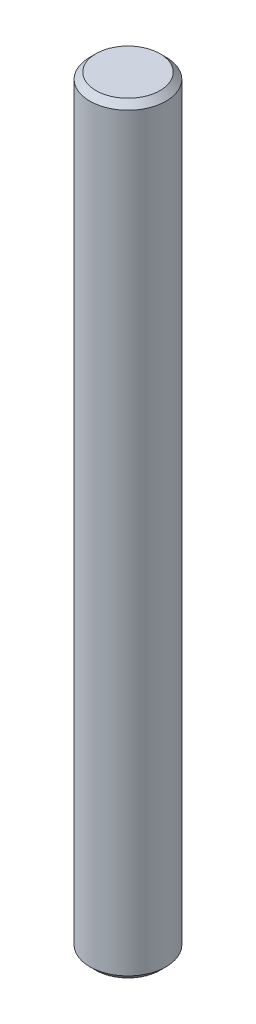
ISO-10303-21;
HEADER;
FILE_DESCRIPTION(('STEP AP214'),'2;1');
FILE_NAME('part.step','',(''),(''),'','','');
FILE_SCHEMA(('AUTOMOTIVE_DESIGN { 1 0 10303 214 1 1 1 1 }'));
ENDSEC;
DATA;
#1=APPLICATION_CONTEXT('core data for automotive mechanical design processes');
#2=APPLICATION_PROTOCOL_DEFINITION('international standard','automotive_design',2000,#1);
#3=PRODUCT_CONTEXT('',#1,'mechanical');
#4=PRODUCT('Part','Part','',(#3));
#5=PRODUCT_RELATED_PRODUCT_CATEGORY('part','',(#4));
#6=PRODUCT_DEFINITION_FORMATION('','',#4);
#7=PRODUCT_DEFINITION_CONTEXT('part definition',#1,'design');
#8=PRODUCT_DEFINITION('design','',#6,#7);
#9=PRODUCT_DEFINITION_SHAPE('','',#8);
#10=(LENGTH_UNIT() NAMED_UNIT(*) SI_UNIT(.MILLI.,.METRE.));
#11=(NAMED_UNIT(*) PLANE_ANGLE_UNIT() SI_UNIT($,.RADIAN.));
#12=(NAMED_UNIT(*) SI_UNIT($,.STERADIAN.) SOLID_ANGLE_UNIT());
#13=UNCERTAINTY_MEASURE_WITH_UNIT(LENGTH_MEASURE(1.E-05),#10,'distance_accuracy_value','');
#14=(GEOMETRIC_REPRESENTATION_CONTEXT(3) GLOBAL_UNCERTAINTY_ASSIGNED_CONTEXT((#13)) GLOBAL_UNIT_ASSIGNED_CONTEXT((#10,
#11,#12)) REPRESENTATION_CONTEXT('',''));
#15=CARTESIAN_POINT('',(0.,0.,0.));
#16=DIRECTION('',(0.,0.,1.));
#17=DIRECTION('',(1.,0.,0.));
#18=AXIS2_PLACEMENT_3D('',#15,#16,#17);
#19=CARTESIAN_POINT('',(0.,125.,0.));
#20=DIRECTION('',(0.,-1.,0.));
#21=DIRECTION('',(0.,0.,-1.));
#22=AXIS2_PLACEMENT_3D('',#19,#20,#21);
#23=CYLINDRICAL_SURFACE('',#22,12.5);
#24=CARTESIAN_POINT('',(0.,-123.,0.));
#25=DIRECTION('',(0.,1.,0.));
#26=DIRECTION('',(0.,0.,1.));
#27=AXIS2_PLACEMENT_3D('',#24,#25,#26);
#28=CIRCLE('',#27,12.5);
#29=CARTESIAN_POINT('',(0.,-123.,12.5));
#30=VERTEX_POINT('',#29);
#31=EDGE_CURVE('E46',#30,#30,#28,.T.);
#32=ORIENTED_EDGE('',*,*,#31,.T.);
#33=EDGE_LOOP('',(#32));
#34=FACE_BOUND('',#33,.T.);
#35=CARTESIAN_POINT('',(0.,123.,0.));
#36=DIRECTION('',(0.,1.,0.));
#37=DIRECTION('',(0.,0.,1.));
#38=AXIS2_PLACEMENT_3D('',#35,#36,#37);
#39=CIRCLE('',#38,12.5);
#40=CARTESIAN_POINT('',(0.,123.,12.5));
#41=VERTEX_POINT('',#40);
#42=EDGE_CURVE('E50',#41,#41,#39,.F.);
#43=ORIENTED_EDGE('',*,*,#42,.T.);
#44=EDGE_LOOP('',(#43));
#45=FACE_BOUND('',#44,.T.);
#46=ADVANCED_FACE('F35',(#34,#45),#23,.T.);
#47=CARTESIAN_POINT('',(0.,125.,0.));
#48=DIRECTION('',(0.,1.,0.));
#49=DIRECTION('',(0.,0.,1.));
#50=AXIS2_PLACEMENT_3D('',#47,#48,#49);
#51=PLANE('',#50);
#52=CARTESIAN_POINT('',(0.,125.,0.));
#53=DIRECTION('',(0.,1.,0.));
#54=DIRECTION('',(0.,0.,1.));
#55=AXIS2_PLACEMENT_3D('',#52,#53,#54);
#56=CIRCLE('',#55,10.5);
#57=CARTESIAN_POINT('',(0.,125.,10.5));
#58=VERTEX_POINT('',#57);
#59=EDGE_CURVE('E10',#58,#58,#56,.T.);
#60=ORIENTED_EDGE('',*,*,#59,.T.);
#61=EDGE_LOOP('',(#60));
#62=FACE_BOUND('',#61,.T.);
#63=ADVANCED_FACE('F66',(#62),#51,.T.);
#64=CARTESIAN_POINT('',(0.,-125.,0.));
#65=DIRECTION('',(0.,1.,0.));
#66=DIRECTION('',(0.,0.,1.));
#67=AXIS2_PLACEMENT_3D('',#64,#65,#66);
#68=PLANE('',#67);
#69=CARTESIAN_POINT('',(0.,-125.,0.));
#70=DIRECTION('',(0.,1.,0.));
#71=DIRECTION('',(0.,0.,1.));
#72=AXIS2_PLACEMENT_3D('',#69,#70,#71);
#73=CIRCLE('',#72,10.5);
#74=CARTESIAN_POINT('',(0.,-125.,10.5));
#75=VERTEX_POINT('',#74);
#76=EDGE_CURVE('E42',#75,#75,#73,.F.);
#77=ORIENTED_EDGE('',*,*,#76,.T.);
#78=EDGE_LOOP('',(#77));
#79=FACE_BOUND('',#78,.T.);
#80=ADVANCED_FACE('F63',(#79),#68,.F.);
#81=CARTESIAN_POINT('',(0.,-123.,0.));
#82=DIRECTION('',(0.,1.,0.));
#83=DIRECTION('',(0.,0.,1.));
#84=AXIS2_PLACEMENT_3D('',#81,#82,#83);
#85=CONICAL_SURFACE('',#84,12.5,0.785398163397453);
#86=ORIENTED_EDGE('',*,*,#76,.F.);
#87=EDGE_LOOP('',(#86));
#88=FACE_BOUND('',#87,.T.);
#89=ORIENTED_EDGE('',*,*,#31,.F.);
#90=EDGE_LOOP('',(#89));
#91=FACE_BOUND('',#90,.T.);
#92=ADVANCED_FACE('F59',(#88,#91),#85,.T.);
#93=CARTESIAN_POINT('',(0.,125.,0.));
#94=DIRECTION('',(0.,-1.,0.));
#95=DIRECTION('',(0.,0.,-1.));
#96=AXIS2_PLACEMENT_3D('',#93,#94,#95);
#97=CONICAL_SURFACE('',#96,10.5,0.785398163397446);
#98=ORIENTED_EDGE('',*,*,#42,.F.);
#99=EDGE_LOOP('',(#98));
#100=FACE_BOUND('',#99,.T.);
#101=ORIENTED_EDGE('',*,*,#59,.F.);
#102=EDGE_LOOP('',(#101));
#103=FACE_BOUND('',#102,.T.);
#104=ADVANCED_FACE('F37',(#100,#103),#97,.T.);
#105=CLOSED_SHELL('',(#46,#63,#80,#92,#104));
#106=MANIFOLD_SOLID_BREP('B2',#105);
#107=ADVANCED_BREP_SHAPE_REPRESENTATION('',(#18,#106),#14);
#108=SHAPE_DEFINITION_REPRESENTATION(#9,#107);
ENDSEC;
END-ISO-10303-21;
